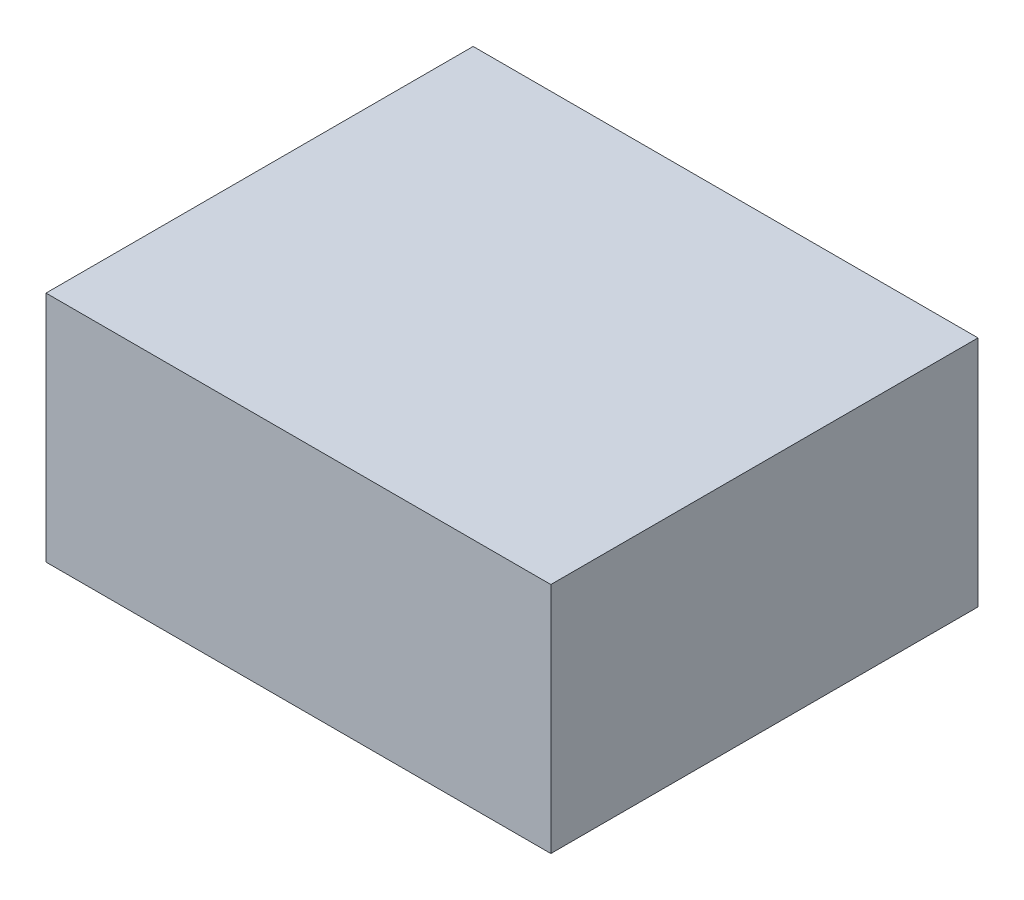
ISO-10303-21;
HEADER;
FILE_DESCRIPTION(('STEP AP214'),'2;1');
FILE_NAME('part.step','',(''),(''),'','','');
FILE_SCHEMA(('AUTOMOTIVE_DESIGN { 1 0 10303 214 1 1 1 1 }'));
ENDSEC;
DATA;
#1=APPLICATION_CONTEXT('core data for automotive mechanical design processes');
#2=APPLICATION_PROTOCOL_DEFINITION('international standard','automotive_design',2000,#1);
#3=PRODUCT_CONTEXT('',#1,'mechanical');
#4=PRODUCT('Part','Part','',(#3));
#5=PRODUCT_RELATED_PRODUCT_CATEGORY('part','',(#4));
#6=PRODUCT_DEFINITION_FORMATION('','',#4);
#7=PRODUCT_DEFINITION_CONTEXT('part definition',#1,'design');
#8=PRODUCT_DEFINITION('design','',#6,#7);
#9=PRODUCT_DEFINITION_SHAPE('','',#8);
#10=(LENGTH_UNIT() NAMED_UNIT(*) SI_UNIT(.MILLI.,.METRE.));
#11=(NAMED_UNIT(*) PLANE_ANGLE_UNIT() SI_UNIT($,.RADIAN.));
#12=(NAMED_UNIT(*) SI_UNIT($,.STERADIAN.) SOLID_ANGLE_UNIT());
#13=UNCERTAINTY_MEASURE_WITH_UNIT(LENGTH_MEASURE(1.E-05),#10,'distance_accuracy_value','');
#14=(GEOMETRIC_REPRESENTATION_CONTEXT(3) GLOBAL_UNCERTAINTY_ASSIGNED_CONTEXT((#13)) GLOBAL_UNIT_ASSIGNED_CONTEXT((#10,
#11,#12)) REPRESENTATION_CONTEXT('',''));
#15=CARTESIAN_POINT('',(0.,0.,0.));
#16=DIRECTION('',(0.,0.,1.));
#17=DIRECTION('',(1.,0.,0.));
#18=AXIS2_PLACEMENT_3D('',#15,#16,#17);
#19=CARTESIAN_POINT('',(0.,0.,0.5499989));
#20=DIRECTION('',(0.,0.,1.));
#21=DIRECTION('',(1.,0.,0.));
#22=AXIS2_PLACEMENT_3D('',#19,#20,#21);
#23=PLANE('',#22);
#24=DIRECTION('',(1.,0.,0.));
#25=VECTOR('',#24,1.);
#26=CARTESIAN_POINT('',(-0.32500062,-0.1499997,0.5499989));
#27=LINE('',#26,#25);
#28=CARTESIAN_POINT('',(-0.32500062,-0.1499997,0.5499989));
#29=VERTEX_POINT('',#28);
#30=CARTESIAN_POINT('',(0.32500062,-0.1499997,0.5499989));
#31=VERTEX_POINT('',#30);
#32=EDGE_CURVE('E82',#29,#31,#27,.T.);
#33=ORIENTED_EDGE('',*,*,#32,.T.);
#34=DIRECTION('',(0.,1.,0.));
#35=VECTOR('',#34,1.);
#36=CARTESIAN_POINT('',(0.32500062,-0.1499997,0.5499989));
#37=LINE('',#36,#35);
#38=CARTESIAN_POINT('',(0.32500062,0.1499997,0.5499989));
#39=VERTEX_POINT('',#38);
#40=EDGE_CURVE('E100',#31,#39,#37,.T.);
#41=ORIENTED_EDGE('',*,*,#40,.T.);
#42=DIRECTION('',(-1.,0.,0.));
#43=VECTOR('',#42,1.);
#44=CARTESIAN_POINT('',(0.32500062,0.1499997,0.5499989));
#45=LINE('',#44,#43);
#46=CARTESIAN_POINT('',(-0.32500062,0.1499997,0.5499989));
#47=VERTEX_POINT('',#46);
#48=EDGE_CURVE('E20',#39,#47,#45,.T.);
#49=ORIENTED_EDGE('',*,*,#48,.T.);
#50=DIRECTION('',(0.,-1.,0.));
#51=VECTOR('',#50,1.);
#52=CARTESIAN_POINT('',(-0.32500062,0.1499997,0.5499989));
#53=LINE('',#52,#51);
#54=EDGE_CURVE('E11',#47,#29,#53,.T.);
#55=ORIENTED_EDGE('',*,*,#54,.T.);
#56=EDGE_LOOP('',(#33,#41,#49,#55));
#57=FACE_BOUND('',#56,.T.);
#58=ADVANCED_FACE('F17',(#57),#23,.T.);
#59=CARTESIAN_POINT('',(0.,0.,0.));
#60=DIRECTION('',(0.,0.,1.));
#61=DIRECTION('',(1.,0.,0.));
#62=AXIS2_PLACEMENT_3D('',#59,#60,#61);
#63=PLANE('',#62);
#64=DIRECTION('',(0.,-1.,0.));
#65=VECTOR('',#64,1.);
#66=CARTESIAN_POINT('',(-0.32500062,0.1499997,0.));
#67=LINE('',#66,#65);
#68=CARTESIAN_POINT('',(-0.32500062,0.1499997,0.));
#69=VERTEX_POINT('',#68);
#70=CARTESIAN_POINT('',(-0.32500062,-0.1499997,0.));
#71=VERTEX_POINT('',#70);
#72=EDGE_CURVE('E26',#69,#71,#67,.T.);
#73=ORIENTED_EDGE('',*,*,#72,.F.);
#74=DIRECTION('',(-1.,0.,0.));
#75=VECTOR('',#74,1.);
#76=CARTESIAN_POINT('',(0.32500062,0.1499997,0.));
#77=LINE('',#76,#75);
#78=CARTESIAN_POINT('',(0.32500062,0.1499997,0.));
#79=VERTEX_POINT('',#78);
#80=EDGE_CURVE('E104',#79,#69,#77,.T.);
#81=ORIENTED_EDGE('',*,*,#80,.F.);
#82=DIRECTION('',(0.,1.,0.));
#83=VECTOR('',#82,1.);
#84=CARTESIAN_POINT('',(0.32500062,-0.1499997,0.));
#85=LINE('',#84,#83);
#86=CARTESIAN_POINT('',(0.32500062,-0.1499997,0.));
#87=VERTEX_POINT('',#86);
#88=EDGE_CURVE('E84',#87,#79,#85,.T.);
#89=ORIENTED_EDGE('',*,*,#88,.F.);
#90=DIRECTION('',(1.,0.,0.));
#91=VECTOR('',#90,1.);
#92=CARTESIAN_POINT('',(-0.32500062,-0.1499997,0.));
#93=LINE('',#92,#91);
#94=EDGE_CURVE('E80',#71,#87,#93,.T.);
#95=ORIENTED_EDGE('',*,*,#94,.F.);
#96=EDGE_LOOP('',(#73,#81,#89,#95));
#97=FACE_BOUND('',#96,.T.);
#98=ADVANCED_FACE('F86',(#97),#63,.F.);
#99=CARTESIAN_POINT('',(-0.32500062,0.1499997,0.));
#100=DIRECTION('',(1.,0.,0.));
#101=DIRECTION('',(0.,1.,0.));
#102=AXIS2_PLACEMENT_3D('',#99,#100,#101);
#103=PLANE('',#102);
#104=ORIENTED_EDGE('',*,*,#72,.T.);
#105=DIRECTION('',(0.,0.,1.));
#106=VECTOR('',#105,1.);
#107=CARTESIAN_POINT('',(-0.32500062,-0.1499997,0.));
#108=LINE('',#107,#106);
#109=EDGE_CURVE('E69',#71,#29,#108,.T.);
#110=ORIENTED_EDGE('',*,*,#109,.T.);
#111=ORIENTED_EDGE('',*,*,#54,.F.);
#112=DIRECTION('',(0.,0.,1.));
#113=VECTOR('',#112,1.);
#114=CARTESIAN_POINT('',(-0.32500062,0.1499997,0.));
#115=LINE('',#114,#113);
#116=EDGE_CURVE('E72',#69,#47,#115,.T.);
#117=ORIENTED_EDGE('',*,*,#116,.F.);
#118=EDGE_LOOP('',(#104,#110,#111,#117));
#119=FACE_BOUND('',#118,.T.);
#120=ADVANCED_FACE('F68',(#119),#103,.F.);
#121=CARTESIAN_POINT('',(0.32500062,0.1499997,0.));
#122=DIRECTION('',(0.,-1.,0.));
#123=DIRECTION('',(0.,0.,-1.));
#124=AXIS2_PLACEMENT_3D('',#121,#122,#123);
#125=PLANE('',#124);
#126=ORIENTED_EDGE('',*,*,#80,.T.);
#127=ORIENTED_EDGE('',*,*,#116,.T.);
#128=ORIENTED_EDGE('',*,*,#48,.F.);
#129=DIRECTION('',(0.,0.,1.));
#130=VECTOR('',#129,1.);
#131=CARTESIAN_POINT('',(0.32500062,0.1499997,0.));
#132=LINE('',#131,#130);
#133=EDGE_CURVE('E105',#79,#39,#132,.T.);
#134=ORIENTED_EDGE('',*,*,#133,.F.);
#135=EDGE_LOOP('',(#126,#127,#128,#134));
#136=FACE_BOUND('',#135,.T.);
#137=ADVANCED_FACE('F122',(#136),#125,.F.);
#138=CARTESIAN_POINT('',(0.32500062,-0.1499997,0.));
#139=DIRECTION('',(-1.,0.,0.));
#140=DIRECTION('',(0.,0.,1.));
#141=AXIS2_PLACEMENT_3D('',#138,#139,#140);
#142=PLANE('',#141);
#143=ORIENTED_EDGE('',*,*,#88,.T.);
#144=ORIENTED_EDGE('',*,*,#133,.T.);
#145=ORIENTED_EDGE('',*,*,#40,.F.);
#146=DIRECTION('',(0.,0.,1.));
#147=VECTOR('',#146,1.);
#148=CARTESIAN_POINT('',(0.32500062,-0.1499997,0.));
#149=LINE('',#148,#147);
#150=EDGE_CURVE('E90',#87,#31,#149,.T.);
#151=ORIENTED_EDGE('',*,*,#150,.F.);
#152=EDGE_LOOP('',(#143,#144,#145,#151));
#153=FACE_BOUND('',#152,.T.);
#154=ADVANCED_FACE('F124',(#153),#142,.F.);
#155=CARTESIAN_POINT('',(-0.32500062,-0.1499997,0.));
#156=DIRECTION('',(0.,1.,0.));
#157=DIRECTION('',(1.,0.,0.));
#158=AXIS2_PLACEMENT_3D('',#155,#156,#157);
#159=PLANE('',#158);
#160=ORIENTED_EDGE('',*,*,#94,.T.);
#161=ORIENTED_EDGE('',*,*,#150,.T.);
#162=ORIENTED_EDGE('',*,*,#32,.F.);
#163=ORIENTED_EDGE('',*,*,#109,.F.);
#164=EDGE_LOOP('',(#160,#161,#162,#163));
#165=FACE_BOUND('',#164,.T.);
#166=ADVANCED_FACE('F78',(#165),#159,.F.);
#167=CLOSED_SHELL('',(#58,#98,#120,#137,#154,#166));
#168=MANIFOLD_SOLID_BREP('B1',#167);
#169=ADVANCED_BREP_SHAPE_REPRESENTATION('',(#18,#168),#14);
#170=SHAPE_DEFINITION_REPRESENTATION(#9,#169);
ENDSEC;
END-ISO-10303-21;
